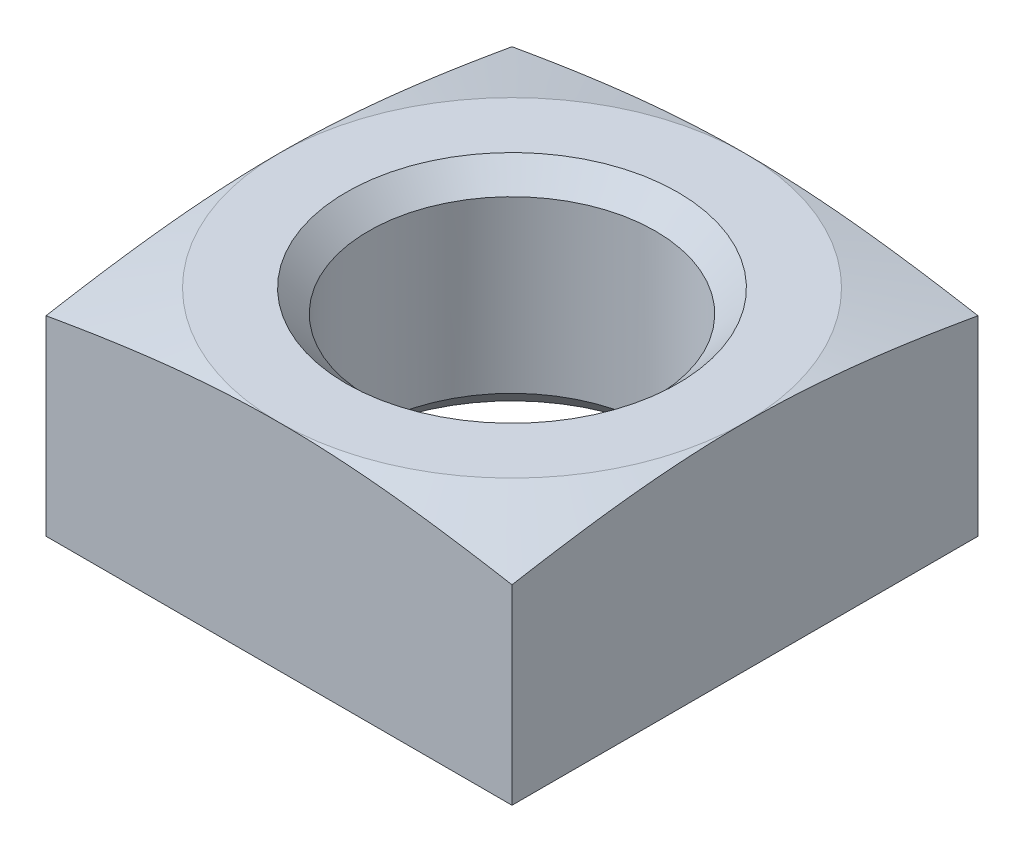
ISO-10303-21;
HEADER;
FILE_DESCRIPTION(('STEP AP214'),'2;1');
FILE_NAME('part.step','',(''),(''),'','','');
FILE_SCHEMA(('AUTOMOTIVE_DESIGN { 1 0 10303 214 1 1 1 1 }'));
ENDSEC;
DATA;
#1=APPLICATION_CONTEXT('core data for automotive mechanical design processes');
#2=APPLICATION_PROTOCOL_DEFINITION('international standard','automotive_design',2000,#1);
#3=PRODUCT_CONTEXT('',#1,'mechanical');
#4=PRODUCT('Part','Part','',(#3));
#5=PRODUCT_RELATED_PRODUCT_CATEGORY('part','',(#4));
#6=PRODUCT_DEFINITION_FORMATION('','',#4);
#7=PRODUCT_DEFINITION_CONTEXT('part definition',#1,'design');
#8=PRODUCT_DEFINITION('design','',#6,#7);
#9=PRODUCT_DEFINITION_SHAPE('','',#8);
#10=(LENGTH_UNIT() NAMED_UNIT(*) SI_UNIT(.MILLI.,.METRE.));
#11=(NAMED_UNIT(*) PLANE_ANGLE_UNIT() SI_UNIT($,.RADIAN.));
#12=(NAMED_UNIT(*) SI_UNIT($,.STERADIAN.) SOLID_ANGLE_UNIT());
#13=UNCERTAINTY_MEASURE_WITH_UNIT(LENGTH_MEASURE(1.E-05),#10,'distance_accuracy_value','');
#14=(GEOMETRIC_REPRESENTATION_CONTEXT(3) GLOBAL_UNCERTAINTY_ASSIGNED_CONTEXT((#13)) GLOBAL_UNIT_ASSIGNED_CONTEXT((#10,
#11,#12)) REPRESENTATION_CONTEXT('',''));
#15=CARTESIAN_POINT('',(0.,0.,0.));
#16=DIRECTION('',(0.,0.,1.));
#17=DIRECTION('',(1.,0.,0.));
#18=AXIS2_PLACEMENT_3D('',#15,#16,#17);
#19=CARTESIAN_POINT('',(6.5,3.,6.5));
#20=DIRECTION('',(0.,0.,-1.));
#21=DIRECTION('',(-1.,0.,0.));
#22=AXIS2_PLACEMENT_3D('',#19,#20,#21);
#23=PLANE('',#22);
#24=DIRECTION('',(0.,-1.,0.));
#25=VECTOR('',#24,1.);
#26=CARTESIAN_POINT('',(6.5,3.,6.5));
#27=LINE('',#26,#25);
#28=CARTESIAN_POINT('',(6.5,2.32690296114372,6.5));
#29=VERTEX_POINT('',#28);
#30=CARTESIAN_POINT('',(6.5,-3.,6.5));
#31=VERTEX_POINT('',#30);
#32=EDGE_CURVE('E122',#29,#31,#27,.T.);
#33=ORIENTED_EDGE('',*,*,#32,.F.);
#34=CARTESIAN_POINT('',(-12.9628449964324,0.999695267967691,6.5));
#35=CARTESIAN_POINT('',(-12.6264668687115,1.07485610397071,6.5));
#36=CARTESIAN_POINT('',(-12.2899674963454,1.14948005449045,6.5));
#37=CARTESIAN_POINT('',(-11.6166640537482,1.29736336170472,6.5));
#38=CARTESIAN_POINT('',(-11.2798599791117,1.37062269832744,6.5));
#39=CARTESIAN_POINT('',(-10.6059490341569,1.51547207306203,6.5));
#40=CARTESIAN_POINT('',(-10.2688422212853,1.58706237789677,6.5));
#41=CARTESIAN_POINT('',(-9.5941983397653,1.72818625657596,6.5));
#42=CARTESIAN_POINT('',(-9.25666127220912,1.79771983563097,6.5));
#43=CARTESIAN_POINT('',(-8.58260949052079,1.93390415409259,6.5));
#44=CARTESIAN_POINT('',(-8.24609715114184,2.00056661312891,6.5));
#45=CARTESIAN_POINT('',(-7.57245245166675,2.13067797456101,6.5));
#46=CARTESIAN_POINT('',(-7.23532009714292,2.19412690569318,6.5));
#47=CARTESIAN_POINT('',(-6.56014031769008,2.31697338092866,6.5));
#48=CARTESIAN_POINT('',(-6.2220925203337,2.37636888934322,6.5));
#49=CARTESIAN_POINT('',(-5.54511353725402,2.48994588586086,6.5));
#50=CARTESIAN_POINT('',(-5.20618234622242,2.54412734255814,6.5));
#51=CARTESIAN_POINT('',(-4.52363407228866,2.64639825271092,6.5));
#52=CARTESIAN_POINT('',(-4.18000602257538,2.69441529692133,6.5));
#53=CARTESIAN_POINT('',(-3.49164533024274,2.78187437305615,6.5));
#54=CARTESIAN_POINT('',(-3.1469126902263,2.82131642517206,6.5));
#55=CARTESIAN_POINT('',(-2.4567579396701,2.8896059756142,6.5));
#56=CARTESIAN_POINT('',(-2.11133698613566,2.91846494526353,6.5));
#57=CARTESIAN_POINT('',(-1.41967553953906,2.9637831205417,6.5));
#58=CARTESIAN_POINT('',(-1.07343507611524,2.98024276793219,6.5));
#59=CARTESIAN_POINT('',(-0.379361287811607,2.99952581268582,6.5));
#60=CARTESIAN_POINT('',(-0.0315266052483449,3.00230168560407,6.5));
#61=CARTESIAN_POINT('',(0.663970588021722,2.99385457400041,6.5));
#62=CARTESIAN_POINT('',(1.01163309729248,2.98263147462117,6.5));
#63=CARTESIAN_POINT('',(1.70662473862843,2.94708121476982,6.5));
#64=CARTESIAN_POINT('',(2.05395317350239,2.92274075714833,6.5));
#65=CARTESIAN_POINT('',(2.7476017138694,2.86266214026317,6.5));
#66=CARTESIAN_POINT('',(3.09392181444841,2.82692392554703,6.5));
#67=CARTESIAN_POINT('',(3.92937691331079,2.7292442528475,6.5));
#68=CARTESIAN_POINT('',(4.41795454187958,2.66258782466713,6.5));
#69=CARTESIAN_POINT('',(5.39309395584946,2.51573659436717,6.5));
#70=CARTESIAN_POINT('',(5.87965540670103,2.43553963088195,6.5));
#71=CARTESIAN_POINT('',(6.85134737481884,2.26557017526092,6.5));
#72=CARTESIAN_POINT('',(7.33647700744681,2.17579268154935,6.5));
#73=CARTESIAN_POINT('',(8.30539819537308,1.98949825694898,6.5));
#74=CARTESIAN_POINT('',(8.78918983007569,1.89298173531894,6.5));
#75=CARTESIAN_POINT('',(9.75667789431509,1.69492275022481,6.5));
#76=CARTESIAN_POINT('',(10.2403724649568,1.5933712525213,6.5));
#77=CARTESIAN_POINT('',(11.2070040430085,1.38671069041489,6.5));
#78=CARTESIAN_POINT('',(11.6899410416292,1.28160158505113,6.5));
#79=CARTESIAN_POINT('',(12.655074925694,1.06876163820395,6.5));
#80=CARTESIAN_POINT('',(13.1372719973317,0.961031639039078,6.5));
#81=CARTESIAN_POINT('',(14.1012091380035,0.743544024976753,6.5));
#82=CARTESIAN_POINT('',(14.5829492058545,0.633786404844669,6.5));
#83=CARTESIAN_POINT('',(16.022016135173,0.303470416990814,6.5));
#84=CARTESIAN_POINT('',(16.9788154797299,0.0806156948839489,6.5));
#85=CARTESIAN_POINT('',(18.8915952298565,-0.368980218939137,6.5));
#86=CARTESIAN_POINT('',(19.8475755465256,-0.595721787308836,6.5));
#87=CARTESIAN_POINT('',(21.7550663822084,-1.0508941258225,6.5));
#88=CARTESIAN_POINT('',(22.7065794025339,-1.27931442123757,6.5));
#89=CARTESIAN_POINT('',(24.1334699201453,-1.62329321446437,6.5));
#90=CARTESIAN_POINT('',(24.6090116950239,-1.73817140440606,6.5));
#91=CARTESIAN_POINT('',(25.5600005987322,-1.9683177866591,6.5));
#92=CARTESIAN_POINT('',(26.0354477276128,-2.08358597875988,6.5));
#93=CARTESIAN_POINT('',(26.5108552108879,-2.19901753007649,6.5));
#94=B_SPLINE_CURVE_WITH_KNOTS('',3,(#34,#35,#36,#37,#38,#39,#40,#41,#42,#43,#44,#45,#46,#47,#48,
#49,#50,#51,#52,#53,#54,#55,#56,#57,#58,#59,#60,#61,#62,#63,#64,#65,#66,#67,#68,#69,#70,#71,#72,
#73,#74,#75,#76,#77,#78,#79,#80,#81,#82,#83,#84,#85,#86,#87,#88,#89,#90,#91,#92,#93),
.UNSPECIFIED.,.F.,.F.,(4,2,2,2,2,2,2,2,2,2,2,2,2,2,2,2,2,2,2,2,2,2,2,2,2,2,2,2,2,4),(0.,
1.03402008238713,2.06805536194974,3.10192424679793,4.13579051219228,5.16493327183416,
6.19406682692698,7.22371348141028,8.25336633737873,9.29418138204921,10.3349939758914,
11.3746750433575,12.4143190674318,13.4575712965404,14.5008320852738,15.5451524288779,
16.5894778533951,18.0684983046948,19.5477550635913,21.0277878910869,22.5077309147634,
23.9904329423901,25.4731520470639,26.9554007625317,28.4376533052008,31.3848678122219,
34.3323695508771,37.2680056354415,38.7356678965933,40.2033293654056),.UNSPECIFIED.);
#95=CARTESIAN_POINT('',(0.,3.,6.5));
#96=VERTEX_POINT('',#95);
#97=EDGE_CURVE('E99',#29,#96,#94,.F.);
#98=ORIENTED_EDGE('',*,*,#97,.T.);
#99=CARTESIAN_POINT('',(-6.5,2.32690296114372,6.5));
#100=VERTEX_POINT('',#99);
#101=EDGE_CURVE('E112',#96,#100,#94,.F.);
#102=ORIENTED_EDGE('',*,*,#101,.T.);
#103=DIRECTION('',(0.,-1.,0.));
#104=VECTOR('',#103,1.);
#105=CARTESIAN_POINT('',(-6.5,3.,6.5));
#106=LINE('',#105,#104);
#107=CARTESIAN_POINT('',(-6.5,-3.,6.5));
#108=VERTEX_POINT('',#107);
#109=EDGE_CURVE('E185',#100,#108,#106,.T.);
#110=ORIENTED_EDGE('',*,*,#109,.T.);
#111=DIRECTION('',(-1.,0.,0.));
#112=VECTOR('',#111,1.);
#113=CARTESIAN_POINT('',(6.5,-3.,6.5));
#114=LINE('',#113,#112);
#115=EDGE_CURVE('E194',#31,#108,#114,.T.);
#116=ORIENTED_EDGE('',*,*,#115,.F.);
#117=EDGE_LOOP('',(#33,#98,#102,#110,#116));
#118=FACE_BOUND('',#117,.T.);
#119=ADVANCED_FACE('F39',(#118),#23,.F.);
#120=CARTESIAN_POINT('',(6.5,-3.,-6.5));
#121=DIRECTION('',(0.,1.,0.));
#122=DIRECTION('',(0.,0.,1.));
#123=AXIS2_PLACEMENT_3D('',#120,#121,#122);
#124=PLANE('',#123);
#125=CARTESIAN_POINT('',(0.,-3.,0.));
#126=DIRECTION('',(0.,1.,0.));
#127=DIRECTION('',(0.,0.,1.));
#128=AXIS2_PLACEMENT_3D('',#125,#126,#127);
#129=CIRCLE('',#128,4.625);
#130=CARTESIAN_POINT('',(0.,-3.,4.625));
#131=VERTEX_POINT('',#130);
#132=EDGE_CURVE('E11',#131,#131,#129,.T.);
#133=ORIENTED_EDGE('',*,*,#132,.T.);
#134=EDGE_LOOP('',(#133));
#135=FACE_BOUND('',#134,.T.);
#136=DIRECTION('',(0.,0.,-1.));
#137=VECTOR('',#136,1.);
#138=CARTESIAN_POINT('',(-6.5,-3.,-6.5));
#139=LINE('',#138,#137);
#140=CARTESIAN_POINT('',(-6.5,-3.,-6.5));
#141=VERTEX_POINT('',#140);
#142=EDGE_CURVE('E188',#108,#141,#139,.T.);
#143=ORIENTED_EDGE('',*,*,#142,.T.);
#144=DIRECTION('',(-1.,0.,0.));
#145=VECTOR('',#144,1.);
#146=CARTESIAN_POINT('',(6.5,-3.,-6.5));
#147=LINE('',#146,#145);
#148=CARTESIAN_POINT('',(6.5,-3.,-6.5));
#149=VERTEX_POINT('',#148);
#150=EDGE_CURVE('E184',#149,#141,#147,.T.);
#151=ORIENTED_EDGE('',*,*,#150,.F.);
#152=DIRECTION('',(0.,0.,-1.));
#153=VECTOR('',#152,1.);
#154=CARTESIAN_POINT('',(6.5,-3.,-6.5));
#155=LINE('',#154,#153);
#156=EDGE_CURVE('E176',#31,#149,#155,.T.);
#157=ORIENTED_EDGE('',*,*,#156,.F.);
#158=ORIENTED_EDGE('',*,*,#115,.T.);
#159=EDGE_LOOP('',(#143,#151,#157,#158));
#160=FACE_BOUND('',#159,.T.);
#161=ADVANCED_FACE('F226',(#135,#160),#124,.F.);
#162=CARTESIAN_POINT('',(6.5,3.,-6.5));
#163=DIRECTION('',(0.,0.,1.));
#164=DIRECTION('',(1.,0.,0.));
#165=AXIS2_PLACEMENT_3D('',#162,#163,#164);
#166=PLANE('',#165);
#167=DIRECTION('',(0.,1.,0.));
#168=VECTOR('',#167,1.);
#169=CARTESIAN_POINT('',(-6.5,3.,-6.5));
#170=LINE('',#169,#168);
#171=CARTESIAN_POINT('',(-6.5,2.32690296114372,-6.5));
#172=VERTEX_POINT('',#171);
#173=EDGE_CURVE('E177',#141,#172,#170,.T.);
#174=ORIENTED_EDGE('',*,*,#173,.T.);
#175=CARTESIAN_POINT('',(-12.9628449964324,0.999695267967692,-6.5));
#176=CARTESIAN_POINT('',(-12.6264668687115,1.07485610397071,-6.5));
#177=CARTESIAN_POINT('',(-12.2899674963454,1.14948005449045,-6.5));
#178=CARTESIAN_POINT('',(-11.6166640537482,1.29736336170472,-6.5));
#179=CARTESIAN_POINT('',(-11.2798599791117,1.37062269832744,-6.5));
#180=CARTESIAN_POINT('',(-10.6059490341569,1.51547207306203,-6.5));
#181=CARTESIAN_POINT('',(-10.2688422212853,1.58706237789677,-6.5));
#182=CARTESIAN_POINT('',(-9.5941983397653,1.72818625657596,-6.5));
#183=CARTESIAN_POINT('',(-9.25666127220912,1.79771983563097,-6.5));
#184=CARTESIAN_POINT('',(-8.58260949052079,1.93390415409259,-6.5));
#185=CARTESIAN_POINT('',(-8.24609715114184,2.00056661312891,-6.5));
#186=CARTESIAN_POINT('',(-7.57245245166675,2.13067797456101,-6.5));
#187=CARTESIAN_POINT('',(-7.23532009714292,2.19412690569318,-6.5));
#188=CARTESIAN_POINT('',(-6.56014031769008,2.31697338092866,-6.5));
#189=CARTESIAN_POINT('',(-6.22209252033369,2.37636888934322,-6.5));
#190=CARTESIAN_POINT('',(-5.54511353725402,2.48994588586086,-6.5));
#191=CARTESIAN_POINT('',(-5.20618234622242,2.54412734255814,-6.5));
#192=CARTESIAN_POINT('',(-4.52363407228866,2.64639825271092,-6.5));
#193=CARTESIAN_POINT('',(-4.18000602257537,2.69441529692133,-6.5));
#194=CARTESIAN_POINT('',(-3.49164533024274,2.78187437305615,-6.5));
#195=CARTESIAN_POINT('',(-3.1469126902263,2.82131642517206,-6.5));
#196=CARTESIAN_POINT('',(-2.45675793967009,2.8896059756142,-6.5));
#197=CARTESIAN_POINT('',(-2.11133698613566,2.91846494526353,-6.5));
#198=CARTESIAN_POINT('',(-1.41967553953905,2.9637831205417,-6.5));
#199=CARTESIAN_POINT('',(-1.07343507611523,2.98024276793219,-6.5));
#200=CARTESIAN_POINT('',(-0.379361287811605,2.99952581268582,-6.5));
#201=CARTESIAN_POINT('',(-0.0315266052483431,3.00230168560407,-6.5));
#202=CARTESIAN_POINT('',(0.663970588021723,2.99385457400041,-6.5));
#203=CARTESIAN_POINT('',(1.01163309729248,2.98263147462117,-6.5));
#204=CARTESIAN_POINT('',(1.70662473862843,2.94708121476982,-6.5));
#205=CARTESIAN_POINT('',(2.05395317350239,2.92274075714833,-6.5));
#206=CARTESIAN_POINT('',(2.74760171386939,2.86266214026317,-6.5));
#207=CARTESIAN_POINT('',(3.09392181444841,2.82692392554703,-6.5));
#208=CARTESIAN_POINT('',(3.92937691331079,2.72924425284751,-6.5));
#209=CARTESIAN_POINT('',(4.41795454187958,2.66258782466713,-6.5));
#210=CARTESIAN_POINT('',(5.39309395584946,2.51573659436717,-6.5));
#211=CARTESIAN_POINT('',(5.87965540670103,2.43553963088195,-6.5));
#212=CARTESIAN_POINT('',(6.85134737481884,2.26557017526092,-6.5));
#213=CARTESIAN_POINT('',(7.33647700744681,2.17579268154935,-6.5));
#214=CARTESIAN_POINT('',(8.30539819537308,1.98949825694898,-6.5));
#215=CARTESIAN_POINT('',(8.78918983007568,1.89298173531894,-6.5));
#216=CARTESIAN_POINT('',(9.75667789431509,1.69492275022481,-6.5));
#217=CARTESIAN_POINT('',(10.2403724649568,1.5933712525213,-6.5));
#218=CARTESIAN_POINT('',(11.2070040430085,1.38671069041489,-6.5));
#219=CARTESIAN_POINT('',(11.6899410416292,1.28160158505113,-6.5));
#220=CARTESIAN_POINT('',(12.655074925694,1.06876163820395,-6.5));
#221=CARTESIAN_POINT('',(13.1372719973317,0.96103163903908,-6.5));
#222=CARTESIAN_POINT('',(14.1012091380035,0.743544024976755,-6.5));
#223=CARTESIAN_POINT('',(14.5829492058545,0.633786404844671,-6.5));
#224=CARTESIAN_POINT('',(16.022016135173,0.303470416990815,-6.5));
#225=CARTESIAN_POINT('',(16.9788154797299,0.0806156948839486,-6.5));
#226=CARTESIAN_POINT('',(18.8915952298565,-0.368980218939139,-6.5));
#227=CARTESIAN_POINT('',(19.8475755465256,-0.595721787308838,-6.5));
#228=CARTESIAN_POINT('',(21.7550663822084,-1.0508941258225,-6.5));
#229=CARTESIAN_POINT('',(22.7065794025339,-1.27931442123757,-6.5));
#230=CARTESIAN_POINT('',(24.1334699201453,-1.62329321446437,-6.5));
#231=CARTESIAN_POINT('',(24.6090116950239,-1.73817140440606,-6.5));
#232=CARTESIAN_POINT('',(25.5600005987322,-1.9683177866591,-6.5));
#233=CARTESIAN_POINT('',(26.0354477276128,-2.08358597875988,-6.5));
#234=CARTESIAN_POINT('',(26.5108552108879,-2.19901753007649,-6.5));
#235=B_SPLINE_CURVE_WITH_KNOTS('',3,(#175,#176,#177,#178,#179,#180,#181,#182,#183,#184,#185,
#186,#187,#188,#189,#190,#191,#192,#193,#194,#195,#196,#197,#198,#199,#200,#201,#202,#203,#204,
#205,#206,#207,#208,#209,#210,#211,#212,#213,#214,#215,#216,#217,#218,#219,#220,#221,#222,#223,
#224,#225,#226,#227,#228,#229,#230,#231,#232,#233,#234),.UNSPECIFIED.,.F.,.F.,(4,2,2,2,2,2,2,2,
2,2,2,2,2,2,2,2,2,2,2,2,2,2,2,2,2,2,2,2,2,4),(0.,1.03402008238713,2.06805536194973,
3.10192424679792,4.13579051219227,5.16493327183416,6.19406682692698,7.22371348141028,
8.25336633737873,9.29418138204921,10.3349939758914,11.3746750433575,12.4143190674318,
13.4575712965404,14.5008320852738,15.5451524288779,16.5894778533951,18.0684983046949,
19.5477550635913,21.0277878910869,22.5077309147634,23.9904329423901,25.4731520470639,
26.9554007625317,28.4376533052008,31.384867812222,34.3323695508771,37.2680056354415,
38.7356678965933,40.2033293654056),.UNSPECIFIED.);
#236=CARTESIAN_POINT('',(0.,3.,-6.5));
#237=VERTEX_POINT('',#236);
#238=EDGE_CURVE('E62',#172,#237,#235,.T.);
#239=ORIENTED_EDGE('',*,*,#238,.T.);
#240=CARTESIAN_POINT('',(6.5,2.32690296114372,-6.5));
#241=VERTEX_POINT('',#240);
#242=EDGE_CURVE('E138',#237,#241,#235,.T.);
#243=ORIENTED_EDGE('',*,*,#242,.T.);
#244=DIRECTION('',(0.,1.,0.));
#245=VECTOR('',#244,1.);
#246=CARTESIAN_POINT('',(6.5,3.,-6.5));
#247=LINE('',#246,#245);
#248=EDGE_CURVE('E180',#149,#241,#247,.T.);
#249=ORIENTED_EDGE('',*,*,#248,.F.);
#250=ORIENTED_EDGE('',*,*,#150,.T.);
#251=EDGE_LOOP('',(#174,#239,#243,#249,#250));
#252=FACE_BOUND('',#251,.T.);
#253=ADVANCED_FACE('F144',(#252),#166,.F.);
#254=CARTESIAN_POINT('',(6.5,0.,0.));
#255=DIRECTION('',(-1.,0.,0.));
#256=DIRECTION('',(0.,0.,1.));
#257=AXIS2_PLACEMENT_3D('',#254,#255,#256);
#258=PLANE('',#257);
#259=ORIENTED_EDGE('',*,*,#248,.T.);
#260=CARTESIAN_POINT('',(6.5,0.999695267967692,-12.9628449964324));
#261=CARTESIAN_POINT('',(6.5,1.07485610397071,-12.6264668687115));
#262=CARTESIAN_POINT('',(6.5,1.14948005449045,-12.2899674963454));
#263=CARTESIAN_POINT('',(6.5,1.29736336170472,-11.6166640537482));
#264=CARTESIAN_POINT('',(6.5,1.37062269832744,-11.2798599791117));
#265=CARTESIAN_POINT('',(6.5,1.51547207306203,-10.6059490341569));
#266=CARTESIAN_POINT('',(6.5,1.58706237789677,-10.2688422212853));
#267=CARTESIAN_POINT('',(6.5,1.72818625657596,-9.5941983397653));
#268=CARTESIAN_POINT('',(6.5,1.79771983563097,-9.25666127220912));
#269=CARTESIAN_POINT('',(6.5,1.93390415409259,-8.58260949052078));
#270=CARTESIAN_POINT('',(6.5,2.00056661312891,-8.24609715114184));
#271=CARTESIAN_POINT('',(6.5,2.13067797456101,-7.57245245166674));
#272=CARTESIAN_POINT('',(6.5,2.19412690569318,-7.23532009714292));
#273=CARTESIAN_POINT('',(6.5,2.31697338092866,-6.56014031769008));
#274=CARTESIAN_POINT('',(6.5,2.37636888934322,-6.22209252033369));
#275=CARTESIAN_POINT('',(6.5,2.48994588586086,-5.54511353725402));
#276=CARTESIAN_POINT('',(6.5,2.54412734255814,-5.20618234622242));
#277=CARTESIAN_POINT('',(6.5,2.64639825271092,-4.52363407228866));
#278=CARTESIAN_POINT('',(6.5,2.69441529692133,-4.18000602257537));
#279=CARTESIAN_POINT('',(6.5,2.78187437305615,-3.49164533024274));
#280=CARTESIAN_POINT('',(6.5,2.82131642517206,-3.1469126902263));
#281=CARTESIAN_POINT('',(6.5,2.8896059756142,-2.45675793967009));
#282=CARTESIAN_POINT('',(6.5,2.91846494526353,-2.11133698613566));
#283=CARTESIAN_POINT('',(6.5,2.9637831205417,-1.41967553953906));
#284=CARTESIAN_POINT('',(6.5,2.98024276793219,-1.07343507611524));
#285=CARTESIAN_POINT('',(6.5,2.99952581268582,-0.379361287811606));
#286=CARTESIAN_POINT('',(6.5,3.00230168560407,-0.0315266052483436));
#287=CARTESIAN_POINT('',(6.5,2.99385457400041,0.663970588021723));
#288=CARTESIAN_POINT('',(6.5,2.98263147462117,1.01163309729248));
#289=CARTESIAN_POINT('',(6.5,2.94708121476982,1.70662473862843));
#290=CARTESIAN_POINT('',(6.5,2.92274075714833,2.05395317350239));
#291=CARTESIAN_POINT('',(6.5,2.86266214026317,2.7476017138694));
#292=CARTESIAN_POINT('',(6.5,2.82692392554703,3.09392181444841));
#293=CARTESIAN_POINT('',(6.5,2.7292442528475,3.92937691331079));
#294=CARTESIAN_POINT('',(6.5,2.66258782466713,4.41795454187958));
#295=CARTESIAN_POINT('',(6.5,2.51573659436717,5.39309395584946));
#296=CARTESIAN_POINT('',(6.5,2.43553963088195,5.87965540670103));
#297=CARTESIAN_POINT('',(6.5,2.26557017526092,6.85134737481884));
#298=CARTESIAN_POINT('',(6.5,2.17579268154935,7.33647700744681));
#299=CARTESIAN_POINT('',(6.5,1.98949825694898,8.30539819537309));
#300=CARTESIAN_POINT('',(6.5,1.89298173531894,8.78918983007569));
#301=CARTESIAN_POINT('',(6.5,1.69492275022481,9.75667789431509));
#302=CARTESIAN_POINT('',(6.5,1.5933712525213,10.2403724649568));
#303=CARTESIAN_POINT('',(6.5,1.38671069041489,11.2070040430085));
#304=CARTESIAN_POINT('',(6.5,1.28160158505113,11.6899410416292));
#305=CARTESIAN_POINT('',(6.5,1.06876163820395,12.6550749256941));
#306=CARTESIAN_POINT('',(6.5,0.961031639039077,13.1372719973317));
#307=CARTESIAN_POINT('',(6.5,0.743544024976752,14.1012091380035));
#308=CARTESIAN_POINT('',(6.5,0.633786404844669,14.5829492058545));
#309=CARTESIAN_POINT('',(6.5,0.303470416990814,16.022016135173));
#310=CARTESIAN_POINT('',(6.5,0.0806156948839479,16.9788154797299));
#311=CARTESIAN_POINT('',(6.5,-0.368980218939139,18.8915952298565));
#312=CARTESIAN_POINT('',(6.5,-0.595721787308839,19.8475755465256));
#313=CARTESIAN_POINT('',(6.5,-1.0508941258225,21.7550663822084));
#314=CARTESIAN_POINT('',(6.5,-1.27931442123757,22.7065794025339));
#315=CARTESIAN_POINT('',(6.5,-1.62329321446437,24.1334699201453));
#316=CARTESIAN_POINT('',(6.5,-1.73817140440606,24.6090116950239));
#317=CARTESIAN_POINT('',(6.5,-1.9683177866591,25.5600005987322));
#318=CARTESIAN_POINT('',(6.5,-2.08358597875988,26.0354477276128));
#319=CARTESIAN_POINT('',(6.5,-2.19901753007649,26.5108552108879));
#320=B_SPLINE_CURVE_WITH_KNOTS('',3,(#260,#261,#262,#263,#264,#265,#266,#267,#268,#269,#270,
#271,#272,#273,#274,#275,#276,#277,#278,#279,#280,#281,#282,#283,#284,#285,#286,#287,#288,#289,
#290,#291,#292,#293,#294,#295,#296,#297,#298,#299,#300,#301,#302,#303,#304,#305,#306,#307,#308,
#309,#310,#311,#312,#313,#314,#315,#316,#317,#318,#319),.UNSPECIFIED.,.F.,.F.,(4,2,2,2,2,2,2,2,
2,2,2,2,2,2,2,2,2,2,2,2,2,2,2,2,2,2,2,2,2,4),(0.,1.03402008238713,2.06805536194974,
3.10192424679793,4.13579051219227,5.16493327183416,6.19406682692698,7.22371348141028,
8.25336633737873,9.29418138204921,10.3349939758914,11.3746750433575,12.4143190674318,
13.4575712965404,14.5008320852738,15.5451524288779,16.5894778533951,18.0684983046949,
19.5477550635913,21.0277878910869,22.5077309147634,23.9904329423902,25.4731520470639,
26.9554007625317,28.4376533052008,31.384867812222,34.3323695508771,37.2680056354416,
38.7356678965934,40.2033293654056),.UNSPECIFIED.);
#321=CARTESIAN_POINT('',(6.5,3.,0.));
#322=VERTEX_POINT('',#321);
#323=EDGE_CURVE('E173',#241,#322,#320,.T.);
#324=ORIENTED_EDGE('',*,*,#323,.T.);
#325=EDGE_CURVE('E101',#322,#29,#320,.T.);
#326=ORIENTED_EDGE('',*,*,#325,.T.);
#327=ORIENTED_EDGE('',*,*,#32,.T.);
#328=ORIENTED_EDGE('',*,*,#156,.T.);
#329=EDGE_LOOP('',(#259,#324,#326,#327,#328));
#330=FACE_BOUND('',#329,.T.);
#331=ADVANCED_FACE('F156',(#330),#258,.F.);
#332=CARTESIAN_POINT('',(-6.5,0.,0.));
#333=DIRECTION('',(-1.,0.,0.));
#334=DIRECTION('',(0.,0.,1.));
#335=AXIS2_PLACEMENT_3D('',#332,#333,#334);
#336=PLANE('',#335);
#337=CARTESIAN_POINT('',(-6.5,0.999695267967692,-12.9628449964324));
#338=CARTESIAN_POINT('',(-6.5,1.07485610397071,-12.6264668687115));
#339=CARTESIAN_POINT('',(-6.5,1.14948005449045,-12.2899674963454));
#340=CARTESIAN_POINT('',(-6.5,1.29736336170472,-11.6166640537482));
#341=CARTESIAN_POINT('',(-6.5,1.37062269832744,-11.2798599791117));
#342=CARTESIAN_POINT('',(-6.5,1.51547207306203,-10.6059490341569));
#343=CARTESIAN_POINT('',(-6.5,1.58706237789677,-10.2688422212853));
#344=CARTESIAN_POINT('',(-6.5,1.72818625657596,-9.5941983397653));
#345=CARTESIAN_POINT('',(-6.5,1.79771983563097,-9.25666127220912));
#346=CARTESIAN_POINT('',(-6.5,1.93390415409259,-8.58260949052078));
#347=CARTESIAN_POINT('',(-6.5,2.00056661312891,-8.24609715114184));
#348=CARTESIAN_POINT('',(-6.5,2.13067797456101,-7.57245245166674));
#349=CARTESIAN_POINT('',(-6.5,2.19412690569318,-7.23532009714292));
#350=CARTESIAN_POINT('',(-6.5,2.31697338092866,-6.56014031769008));
#351=CARTESIAN_POINT('',(-6.5,2.37636888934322,-6.22209252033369));
#352=CARTESIAN_POINT('',(-6.5,2.48994588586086,-5.54511353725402));
#353=CARTESIAN_POINT('',(-6.5,2.54412734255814,-5.20618234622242));
#354=CARTESIAN_POINT('',(-6.5,2.64639825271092,-4.52363407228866));
#355=CARTESIAN_POINT('',(-6.5,2.69441529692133,-4.18000602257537));
#356=CARTESIAN_POINT('',(-6.5,2.78187437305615,-3.49164533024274));
#357=CARTESIAN_POINT('',(-6.5,2.82131642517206,-3.1469126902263));
#358=CARTESIAN_POINT('',(-6.5,2.8896059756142,-2.45675793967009));
#359=CARTESIAN_POINT('',(-6.5,2.91846494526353,-2.11133698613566));
#360=CARTESIAN_POINT('',(-6.5,2.9637831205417,-1.41967553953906));
#361=CARTESIAN_POINT('',(-6.5,2.98024276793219,-1.07343507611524));
#362=CARTESIAN_POINT('',(-6.5,2.99952581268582,-0.379361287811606));
#363=CARTESIAN_POINT('',(-6.5,3.00230168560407,-0.0315266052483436));
#364=CARTESIAN_POINT('',(-6.5,2.99385457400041,0.663970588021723));
#365=CARTESIAN_POINT('',(-6.5,2.98263147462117,1.01163309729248));
#366=CARTESIAN_POINT('',(-6.5,2.94708121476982,1.70662473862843));
#367=CARTESIAN_POINT('',(-6.5,2.92274075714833,2.05395317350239));
#368=CARTESIAN_POINT('',(-6.5,2.86266214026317,2.7476017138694));
#369=CARTESIAN_POINT('',(-6.5,2.82692392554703,3.09392181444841));
#370=CARTESIAN_POINT('',(-6.5,2.7292442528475,3.92937691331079));
#371=CARTESIAN_POINT('',(-6.5,2.66258782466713,4.41795454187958));
#372=CARTESIAN_POINT('',(-6.5,2.51573659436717,5.39309395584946));
#373=CARTESIAN_POINT('',(-6.5,2.43553963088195,5.87965540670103));
#374=CARTESIAN_POINT('',(-6.5,2.26557017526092,6.85134737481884));
#375=CARTESIAN_POINT('',(-6.5,2.17579268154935,7.33647700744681));
#376=CARTESIAN_POINT('',(-6.5,1.98949825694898,8.30539819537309));
#377=CARTESIAN_POINT('',(-6.5,1.89298173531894,8.78918983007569));
#378=CARTESIAN_POINT('',(-6.5,1.69492275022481,9.75667789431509));
#379=CARTESIAN_POINT('',(-6.5,1.5933712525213,10.2403724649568));
#380=CARTESIAN_POINT('',(-6.5,1.38671069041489,11.2070040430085));
#381=CARTESIAN_POINT('',(-6.5,1.28160158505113,11.6899410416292));
#382=CARTESIAN_POINT('',(-6.5,1.06876163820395,12.6550749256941));
#383=CARTESIAN_POINT('',(-6.5,0.961031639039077,13.1372719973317));
#384=CARTESIAN_POINT('',(-6.5,0.743544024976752,14.1012091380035));
#385=CARTESIAN_POINT('',(-6.5,0.633786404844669,14.5829492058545));
#386=CARTESIAN_POINT('',(-6.5,0.303470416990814,16.022016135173));
#387=CARTESIAN_POINT('',(-6.5,0.0806156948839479,16.9788154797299));
#388=CARTESIAN_POINT('',(-6.5,-0.368980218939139,18.8915952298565));
#389=CARTESIAN_POINT('',(-6.5,-0.595721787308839,19.8475755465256));
#390=CARTESIAN_POINT('',(-6.5,-1.0508941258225,21.7550663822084));
#391=CARTESIAN_POINT('',(-6.5,-1.27931442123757,22.7065794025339));
#392=CARTESIAN_POINT('',(-6.5,-1.62329321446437,24.1334699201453));
#393=CARTESIAN_POINT('',(-6.5,-1.73817140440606,24.6090116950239));
#394=CARTESIAN_POINT('',(-6.5,-1.9683177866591,25.5600005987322));
#395=CARTESIAN_POINT('',(-6.5,-2.08358597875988,26.0354477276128));
#396=CARTESIAN_POINT('',(-6.5,-2.19901753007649,26.5108552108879));
#397=B_SPLINE_CURVE_WITH_KNOTS('',3,(#337,#338,#339,#340,#341,#342,#343,#344,#345,#346,#347,
#348,#349,#350,#351,#352,#353,#354,#355,#356,#357,#358,#359,#360,#361,#362,#363,#364,#365,#366,
#367,#368,#369,#370,#371,#372,#373,#374,#375,#376,#377,#378,#379,#380,#381,#382,#383,#384,#385,
#386,#387,#388,#389,#390,#391,#392,#393,#394,#395,#396),.UNSPECIFIED.,.F.,.F.,(4,2,2,2,2,2,2,2,
2,2,2,2,2,2,2,2,2,2,2,2,2,2,2,2,2,2,2,2,2,4),(0.,1.03402008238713,2.06805536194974,
3.10192424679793,4.13579051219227,5.16493327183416,6.19406682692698,7.22371348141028,
8.25336633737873,9.29418138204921,10.3349939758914,11.3746750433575,12.4143190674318,
13.4575712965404,14.5008320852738,15.5451524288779,16.5894778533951,18.0684983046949,
19.5477550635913,21.0277878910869,22.5077309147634,23.9904329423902,25.4731520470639,
26.9554007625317,28.4376533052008,31.384867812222,34.3323695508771,37.2680056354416,
38.7356678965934,40.2033293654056),.UNSPECIFIED.);
#398=CARTESIAN_POINT('',(-6.5,3.,0.));
#399=VERTEX_POINT('',#398);
#400=EDGE_CURVE('E55',#172,#399,#397,.T.);
#401=ORIENTED_EDGE('',*,*,#400,.F.);
#402=ORIENTED_EDGE('',*,*,#173,.F.);
#403=ORIENTED_EDGE('',*,*,#142,.F.);
#404=ORIENTED_EDGE('',*,*,#109,.F.);
#405=EDGE_CURVE('E115',#399,#100,#397,.T.);
#406=ORIENTED_EDGE('',*,*,#405,.F.);
#407=EDGE_LOOP('',(#401,#402,#403,#404,#406));
#408=FACE_BOUND('',#407,.T.);
#409=ADVANCED_FACE('F241',(#408),#336,.T.);
#410=CARTESIAN_POINT('',(0.,2.3,0.));
#411=DIRECTION('',(0.,-1.,0.));
#412=DIRECTION('',(0.,0.,-1.));
#413=AXIS2_PLACEMENT_3D('',#410,#411,#412);
#414=CONICAL_SURFACE('',#413,9.3,1.32581766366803);
#415=CARTESIAN_POINT('',(0.,3.,0.));
#416=DIRECTION('',(0.,1.,0.));
#417=DIRECTION('',(0.,0.,1.));
#418=AXIS2_PLACEMENT_3D('',#415,#416,#417);
#419=CIRCLE('',#418,6.5);
#420=EDGE_CURVE('E109',#399,#96,#419,.T.);
#421=ORIENTED_EDGE('',*,*,#420,.F.);
#422=ORIENTED_EDGE('',*,*,#405,.T.);
#423=ORIENTED_EDGE('',*,*,#101,.F.);
#424=EDGE_LOOP('',(#421,#422,#423));
#425=FACE_BOUND('',#424,.T.);
#426=ADVANCED_FACE('F113',(#425),#414,.T.);
#427=ORIENTED_EDGE('',*,*,#400,.T.);
#428=EDGE_CURVE('E126',#237,#399,#419,.T.);
#429=ORIENTED_EDGE('',*,*,#428,.F.);
#430=ORIENTED_EDGE('',*,*,#238,.F.);
#431=EDGE_LOOP('',(#427,#429,#430));
#432=FACE_BOUND('',#431,.T.);
#433=ADVANCED_FACE('F154',(#432),#414,.T.);
#434=EDGE_CURVE('E95',#96,#322,#419,.T.);
#435=ORIENTED_EDGE('',*,*,#434,.F.);
#436=ORIENTED_EDGE('',*,*,#97,.F.);
#437=ORIENTED_EDGE('',*,*,#325,.F.);
#438=EDGE_LOOP('',(#435,#436,#437));
#439=FACE_BOUND('',#438,.T.);
#440=ADVANCED_FACE('F97',(#439),#414,.T.);
#441=EDGE_CURVE('E107',#322,#237,#419,.T.);
#442=ORIENTED_EDGE('',*,*,#441,.F.);
#443=ORIENTED_EDGE('',*,*,#323,.F.);
#444=ORIENTED_EDGE('',*,*,#242,.F.);
#445=EDGE_LOOP('',(#442,#443,#444));
#446=FACE_BOUND('',#445,.T.);
#447=ADVANCED_FACE('F148',(#446),#414,.T.);
#448=CARTESIAN_POINT('',(6.5,3.,-6.5));
#449=DIRECTION('',(0.,-1.,0.));
#450=DIRECTION('',(0.,0.,-1.));
#451=AXIS2_PLACEMENT_3D('',#448,#449,#450);
#452=PLANE('',#451);
#453=CARTESIAN_POINT('',(0.,3.,0.));
#454=DIRECTION('',(0.,-1.,0.));
#455=DIRECTION('',(0.,0.,-1.));
#456=AXIS2_PLACEMENT_3D('',#453,#454,#455);
#457=CIRCLE('',#456,4.625);
#458=CARTESIAN_POINT('',(0.,3.,-4.625));
#459=VERTEX_POINT('',#458);
#460=EDGE_CURVE('E48',#459,#459,#457,.T.);
#461=ORIENTED_EDGE('',*,*,#460,.T.);
#462=EDGE_LOOP('',(#461));
#463=FACE_BOUND('',#462,.T.);
#464=ORIENTED_EDGE('',*,*,#441,.T.);
#465=ORIENTED_EDGE('',*,*,#428,.T.);
#466=ORIENTED_EDGE('',*,*,#420,.T.);
#467=ORIENTED_EDGE('',*,*,#434,.T.);
#468=EDGE_LOOP('',(#464,#465,#466,#467));
#469=FACE_BOUND('',#468,.T.);
#470=ADVANCED_FACE('F125',(#463,#469),#452,.F.);
#471=CARTESIAN_POINT('',(0.,-14.3137084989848,0.));
#472=DIRECTION('',(0.,1.,0.));
#473=DIRECTION('',(0.,0.,1.));
#474=AXIS2_PLACEMENT_3D('',#471,#472,#473);
#475=CYLINDRICAL_SURFACE('',#474,4.);
#476=CARTESIAN_POINT('',(0.,2.375,0.));
#477=DIRECTION('',(0.,-1.,0.));
#478=DIRECTION('',(0.,0.,-1.));
#479=AXIS2_PLACEMENT_3D('',#476,#477,#478);
#480=CIRCLE('',#479,4.);
#481=CARTESIAN_POINT('',(0.,2.375,-4.));
#482=VERTEX_POINT('',#481);
#483=EDGE_CURVE('E204',#482,#482,#480,.F.);
#484=ORIENTED_EDGE('',*,*,#483,.T.);
#485=EDGE_LOOP('',(#484));
#486=FACE_BOUND('',#485,.T.);
#487=CARTESIAN_POINT('',(0.,-2.375,0.));
#488=DIRECTION('',(0.,1.,0.));
#489=DIRECTION('',(0.,0.,1.));
#490=AXIS2_PLACEMENT_3D('',#487,#488,#489);
#491=CIRCLE('',#490,4.);
#492=CARTESIAN_POINT('',(0.,-2.375,4.));
#493=VERTEX_POINT('',#492);
#494=EDGE_CURVE('E201',#493,#493,#491,.F.);
#495=ORIENTED_EDGE('',*,*,#494,.T.);
#496=EDGE_LOOP('',(#495));
#497=FACE_BOUND('',#496,.T.);
#498=ADVANCED_FACE('F155',(#486,#497),#475,.F.);
#499=CARTESIAN_POINT('',(0.,2.375,0.));
#500=DIRECTION('',(0.,1.,0.));
#501=DIRECTION('',(0.,0.,1.));
#502=AXIS2_PLACEMENT_3D('',#499,#500,#501);
#503=CONICAL_SURFACE('',#502,4.,0.78539816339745);
#504=ORIENTED_EDGE('',*,*,#460,.F.);
#505=EDGE_LOOP('',(#504));
#506=FACE_BOUND('',#505,.T.);
#507=ORIENTED_EDGE('',*,*,#483,.F.);
#508=EDGE_LOOP('',(#507));
#509=FACE_BOUND('',#508,.T.);
#510=ADVANCED_FACE('F216',(#506,#509),#503,.F.);
#511=CARTESIAN_POINT('',(0.,-2.375,0.));
#512=DIRECTION('',(0.,-1.,0.));
#513=DIRECTION('',(0.,0.,-1.));
#514=AXIS2_PLACEMENT_3D('',#511,#512,#513);
#515=CONICAL_SURFACE('',#514,4.,0.785398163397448);
#516=ORIENTED_EDGE('',*,*,#132,.F.);
#517=EDGE_LOOP('',(#516));
#518=FACE_BOUND('',#517,.T.);
#519=ORIENTED_EDGE('',*,*,#494,.F.);
#520=EDGE_LOOP('',(#519));
#521=FACE_BOUND('',#520,.T.);
#522=ADVANCED_FACE('F41',(#518,#521),#515,.F.);
#523=CLOSED_SHELL('',(#119,#161,#253,#331,#409,#426,#433,#440,#447,#470,#498,#510,#522));
#524=MANIFOLD_SOLID_BREP('B2',#523);
#525=ADVANCED_BREP_SHAPE_REPRESENTATION('',(#18,#524),#14);
#526=SHAPE_DEFINITION_REPRESENTATION(#9,#525);
ENDSEC;
END-ISO-10303-21;
